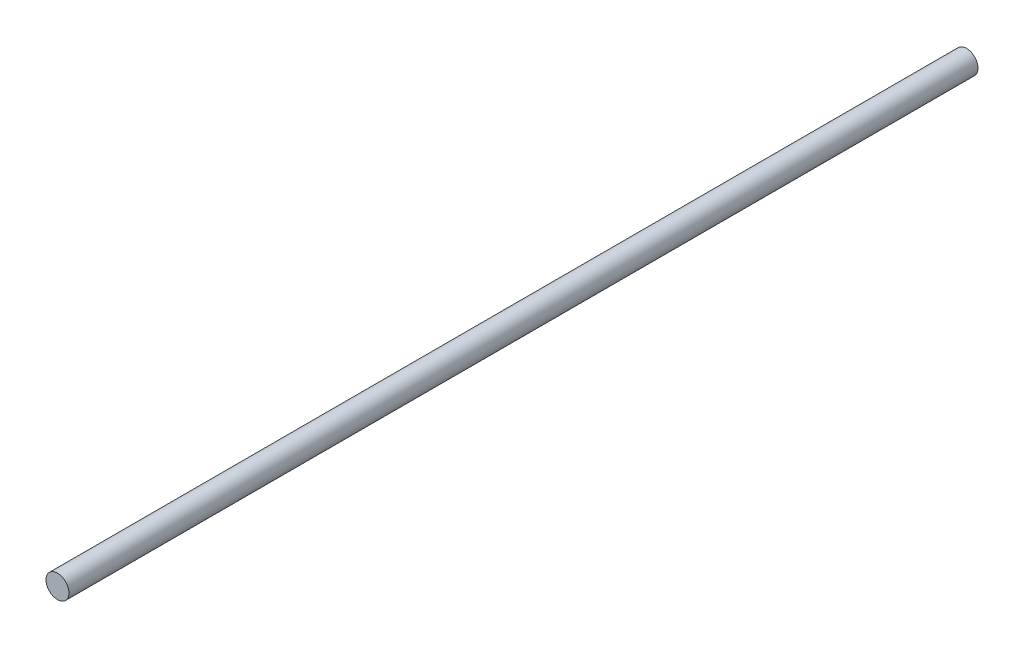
ISO-10303-21;
HEADER;
FILE_DESCRIPTION(('STEP AP214'),'2;1');
FILE_NAME('part.step','',(''),(''),'','','');
FILE_SCHEMA(('AUTOMOTIVE_DESIGN { 1 0 10303 214 1 1 1 1 }'));
ENDSEC;
DATA;
#1=APPLICATION_CONTEXT('core data for automotive mechanical design processes');
#2=APPLICATION_PROTOCOL_DEFINITION('international standard','automotive_design',2000,#1);
#3=PRODUCT_CONTEXT('',#1,'mechanical');
#4=PRODUCT('Part','Part','',(#3));
#5=PRODUCT_RELATED_PRODUCT_CATEGORY('part','',(#4));
#6=PRODUCT_DEFINITION_FORMATION('','',#4);
#7=PRODUCT_DEFINITION_CONTEXT('part definition',#1,'design');
#8=PRODUCT_DEFINITION('design','',#6,#7);
#9=PRODUCT_DEFINITION_SHAPE('','',#8);
#10=(LENGTH_UNIT() NAMED_UNIT(*) SI_UNIT(.MILLI.,.METRE.));
#11=(NAMED_UNIT(*) PLANE_ANGLE_UNIT() SI_UNIT($,.RADIAN.));
#12=(NAMED_UNIT(*) SI_UNIT($,.STERADIAN.) SOLID_ANGLE_UNIT());
#13=UNCERTAINTY_MEASURE_WITH_UNIT(LENGTH_MEASURE(1.E-05),#10,'distance_accuracy_value','');
#14=(GEOMETRIC_REPRESENTATION_CONTEXT(3) GLOBAL_UNCERTAINTY_ASSIGNED_CONTEXT((#13)) GLOBAL_UNIT_ASSIGNED_CONTEXT((#10,
#11,#12)) REPRESENTATION_CONTEXT('',''));
#15=CARTESIAN_POINT('',(0.,0.,0.));
#16=DIRECTION('',(0.,0.,1.));
#17=DIRECTION('',(1.,0.,0.));
#18=AXIS2_PLACEMENT_3D('',#15,#16,#17);
#19=CARTESIAN_POINT('',(0.,0.,118.532696));
#20=DIRECTION('',(0.,0.,1.));
#21=DIRECTION('',(1.,0.,0.));
#22=AXIS2_PLACEMENT_3D('',#19,#20,#21);
#23=PLANE('',#22);
#24=CARTESIAN_POINT('',(0.,0.,118.532696));
#25=DIRECTION('',(0.,0.,1.));
#26=DIRECTION('',(1.,0.,0.));
#27=AXIS2_PLACEMENT_3D('',#24,#25,#26);
#28=CIRCLE('',#27,1.5);
#29=CARTESIAN_POINT('',(1.5,0.,118.532696));
#30=VERTEX_POINT('',#29);
#31=EDGE_CURVE('E10',#30,#30,#28,.T.);
#32=ORIENTED_EDGE('',*,*,#31,.T.);
#33=EDGE_LOOP('',(#32));
#34=FACE_BOUND('',#33,.T.);
#35=ADVANCED_FACE('F16',(#34),#23,.T.);
#36=CARTESIAN_POINT('',(0.,0.,0.));
#37=DIRECTION('',(0.,0.,1.));
#38=DIRECTION('',(1.,0.,0.));
#39=AXIS2_PLACEMENT_3D('',#36,#37,#38);
#40=PLANE('',#39);
#41=CARTESIAN_POINT('',(0.,0.,0.));
#42=DIRECTION('',(0.,0.,1.));
#43=DIRECTION('',(1.,0.,0.));
#44=AXIS2_PLACEMENT_3D('',#41,#42,#43);
#45=CIRCLE('',#44,1.5);
#46=CARTESIAN_POINT('',(1.5,0.,0.));
#47=VERTEX_POINT('',#46);
#48=EDGE_CURVE('E41',#47,#47,#45,.T.);
#49=ORIENTED_EDGE('',*,*,#48,.F.);
#50=EDGE_LOOP('',(#49));
#51=FACE_BOUND('',#50,.T.);
#52=ADVANCED_FACE('F55',(#51),#40,.F.);
#53=CARTESIAN_POINT('',(0.,0.,0.));
#54=DIRECTION('',(0.,0.,-1.));
#55=DIRECTION('',(1.,0.,0.));
#56=AXIS2_PLACEMENT_3D('',#53,#54,#55);
#57=CYLINDRICAL_SURFACE('',#56,1.5);
#58=ORIENTED_EDGE('',*,*,#48,.T.);
#59=DIRECTION('',(0.,0.,1.));
#60=VECTOR('',#59,1.);
#61=CARTESIAN_POINT('',(1.5,0.,0.));
#62=LINE('',#61,#60);
#63=EDGE_CURVE('E24',#47,#30,#62,.T.);
#64=ORIENTED_EDGE('',*,*,#63,.T.);
#65=ORIENTED_EDGE('',*,*,#31,.F.);
#66=ORIENTED_EDGE('',*,*,#63,.F.);
#67=EDGE_LOOP('',(#58,#64,#65,#66));
#68=FACE_BOUND('',#67,.T.);
#69=ADVANCED_FACE('F39',(#68),#57,.T.);
#70=CLOSED_SHELL('',(#35,#52,#69));
#71=MANIFOLD_SOLID_BREP('B1',#70);
#72=ADVANCED_BREP_SHAPE_REPRESENTATION('',(#18,#71),#14);
#73=SHAPE_DEFINITION_REPRESENTATION(#9,#72);
ENDSEC;
END-ISO-10303-21;
